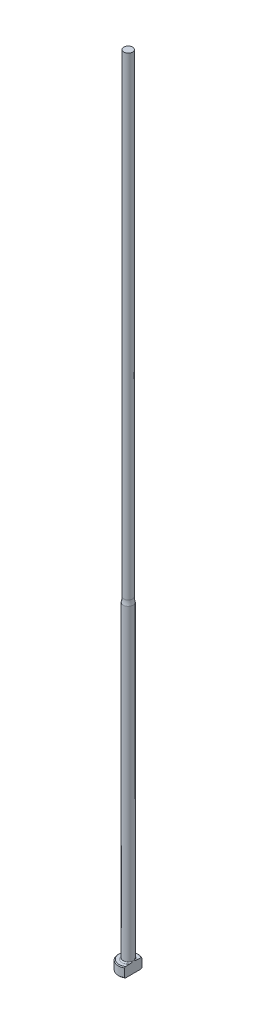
ISO-10303-21;
HEADER;
FILE_DESCRIPTION(('STEP AP214'),'2;1');
FILE_NAME('part.step','',(''),(''),'','','');
FILE_SCHEMA(('AUTOMOTIVE_DESIGN { 1 0 10303 214 1 1 1 1 }'));
ENDSEC;
DATA;
#1=APPLICATION_CONTEXT('core data for automotive mechanical design processes');
#2=APPLICATION_PROTOCOL_DEFINITION('international standard','automotive_design',2000,#1);
#3=PRODUCT_CONTEXT('',#1,'mechanical');
#4=PRODUCT('Part','Part','',(#3));
#5=PRODUCT_RELATED_PRODUCT_CATEGORY('part','',(#4));
#6=PRODUCT_DEFINITION_FORMATION('','',#4);
#7=PRODUCT_DEFINITION_CONTEXT('part definition',#1,'design');
#8=PRODUCT_DEFINITION('design','',#6,#7);
#9=PRODUCT_DEFINITION_SHAPE('','',#8);
#10=(LENGTH_UNIT() NAMED_UNIT(*) SI_UNIT(.MILLI.,.METRE.));
#11=(NAMED_UNIT(*) PLANE_ANGLE_UNIT() SI_UNIT($,.RADIAN.));
#12=(NAMED_UNIT(*) SI_UNIT($,.STERADIAN.) SOLID_ANGLE_UNIT());
#13=UNCERTAINTY_MEASURE_WITH_UNIT(LENGTH_MEASURE(1.E-05),#10,'distance_accuracy_value','');
#14=(GEOMETRIC_REPRESENTATION_CONTEXT(3) GLOBAL_UNCERTAINTY_ASSIGNED_CONTEXT((#13)) GLOBAL_UNIT_ASSIGNED_CONTEXT((#10,
#11,#12)) REPRESENTATION_CONTEXT('',''));
#15=CARTESIAN_POINT('',(0.,0.,0.));
#16=DIRECTION('',(0.,0.,1.));
#17=DIRECTION('',(1.,0.,0.));
#18=AXIS2_PLACEMENT_3D('',#15,#16,#17);
#19=CARTESIAN_POINT('',(-3.17499999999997,3.175,0.));
#20=DIRECTION('',(0.,1.,0.));
#21=DIRECTION('',(0.,0.,1.));
#22=AXIS2_PLACEMENT_3D('',#19,#20,#21);
#23=PLANE('',#22);
#24=CARTESIAN_POINT('',(0.,3.175,0.));
#25=DIRECTION('',(0.,1.,0.));
#26=DIRECTION('',(0.,0.,1.));
#27=AXIS2_PLACEMENT_3D('',#24,#25,#26);
#28=CIRCLE('',#27,2.92099999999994);
#29=CARTESIAN_POINT('',(1.58749999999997,3.175,-2.45195529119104));
#30=VERTEX_POINT('',#29);
#31=CARTESIAN_POINT('',(1.58749999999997,3.175,2.45195529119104));
#32=VERTEX_POINT('',#31);
#33=EDGE_CURVE('E105',#30,#32,#28,.T.);
#34=ORIENTED_EDGE('',*,*,#33,.T.);
#35=DIRECTION('',(0.,0.,1.));
#36=VECTOR('',#35,1.);
#37=CARTESIAN_POINT('',(1.58749999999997,3.17499999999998,2.74963065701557));
#38=LINE('',#37,#36);
#39=CARTESIAN_POINT('',(1.58749999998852,3.175,1.16397422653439));
#40=VERTEX_POINT('',#39);
#41=EDGE_CURVE('E126',#40,#32,#38,.T.);
#42=ORIENTED_EDGE('',*,*,#41,.F.);
#43=CARTESIAN_POINT('',(0.,3.175,0.));
#44=DIRECTION('',(0.,1.,0.));
#45=DIRECTION('',(0.,0.,1.));
#46=AXIS2_PLACEMENT_3D('',#43,#44,#45);
#47=CIRCLE('',#46,1.96849999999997);
#48=CARTESIAN_POINT('',(1.58749999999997,3.175,-1.16397422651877));
#49=VERTEX_POINT('',#48);
#50=EDGE_CURVE('E11',#40,#49,#47,.F.);
#51=ORIENTED_EDGE('',*,*,#50,.T.);
#52=EDGE_CURVE('E52',#30,#49,#38,.T.);
#53=ORIENTED_EDGE('',*,*,#52,.F.);
#54=EDGE_LOOP('',(#34,#42,#51,#53));
#55=FACE_BOUND('',#54,.T.);
#56=ADVANCED_FACE('F32',(#55),#23,.T.);
#57=CARTESIAN_POINT('',(0.,259.958771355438,0.));
#58=DIRECTION('',(0.,1.,0.));
#59=DIRECTION('',(0.,0.,1.));
#60=AXIS2_PLACEMENT_3D('',#57,#58,#59);
#61=CYLINDRICAL_SURFACE('',#60,3.17499999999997);
#62=CARTESIAN_POINT('',(0.,2.92100000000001,0.));
#63=DIRECTION('',(0.,1.,0.));
#64=DIRECTION('',(0.,0.,1.));
#65=AXIS2_PLACEMENT_3D('',#62,#63,#64);
#66=CIRCLE('',#65,3.17499999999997);
#67=CARTESIAN_POINT('',(1.58749999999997,2.92100000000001,2.74963065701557));
#68=VERTEX_POINT('',#67);
#69=CARTESIAN_POINT('',(1.58749999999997,2.92100000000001,-2.74963065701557));
#70=VERTEX_POINT('',#69);
#71=EDGE_CURVE('E98',#68,#70,#66,.F.);
#72=ORIENTED_EDGE('',*,*,#71,.T.);
#73=DIRECTION('',(0.,-1.,0.));
#74=VECTOR('',#73,1.);
#75=CARTESIAN_POINT('',(1.58749999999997,254.001,-2.74963065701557));
#76=LINE('',#75,#74);
#77=CARTESIAN_POINT('',(1.58749999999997,0.253999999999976,-2.74963065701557));
#78=VERTEX_POINT('',#77);
#79=EDGE_CURVE('E141',#70,#78,#76,.T.);
#80=ORIENTED_EDGE('',*,*,#79,.T.);
#81=CARTESIAN_POINT('',(0.,0.253999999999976,0.));
#82=DIRECTION('',(0.,-1.,0.));
#83=DIRECTION('',(0.,0.,-1.));
#84=AXIS2_PLACEMENT_3D('',#81,#82,#83);
#85=CIRCLE('',#84,3.17499999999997);
#86=CARTESIAN_POINT('',(1.58749999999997,0.253999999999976,2.74963065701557));
#87=VERTEX_POINT('',#86);
#88=EDGE_CURVE('E95',#78,#87,#85,.F.);
#89=ORIENTED_EDGE('',*,*,#88,.T.);
#90=DIRECTION('',(0.,-1.,0.));
#91=VECTOR('',#90,1.);
#92=CARTESIAN_POINT('',(1.58749999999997,254.001,2.74963065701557));
#93=LINE('',#92,#91);
#94=EDGE_CURVE('E88',#68,#87,#93,.T.);
#95=ORIENTED_EDGE('',*,*,#94,.F.);
#96=EDGE_LOOP('',(#72,#80,#89,#95));
#97=FACE_BOUND('',#96,.T.);
#98=ADVANCED_FACE('F191',(#97),#61,.T.);
#99=CARTESIAN_POINT('',(0.,0.,0.));
#100=DIRECTION('',(0.,-1.,0.));
#101=DIRECTION('',(0.,0.,-1.));
#102=AXIS2_PLACEMENT_3D('',#99,#100,#101);
#103=PLANE('',#102);
#104=CARTESIAN_POINT('',(0.,0.,0.));
#105=DIRECTION('',(0.,-1.,0.));
#106=DIRECTION('',(0.,0.,-1.));
#107=AXIS2_PLACEMENT_3D('',#104,#105,#106);
#108=CIRCLE('',#107,2.92100000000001);
#109=CARTESIAN_POINT('',(1.58749999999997,0.,2.45195529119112));
#110=VERTEX_POINT('',#109);
#111=CARTESIAN_POINT('',(1.58749999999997,0.,-2.45195529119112));
#112=VERTEX_POINT('',#111);
#113=EDGE_CURVE('E93',#110,#112,#108,.T.);
#114=ORIENTED_EDGE('',*,*,#113,.T.);
#115=DIRECTION('',(0.,0.,1.));
#116=VECTOR('',#115,1.);
#117=CARTESIAN_POINT('',(1.58749999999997,0.,2.74963065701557));
#118=LINE('',#117,#116);
#119=EDGE_CURVE('E78',#112,#110,#118,.T.);
#120=ORIENTED_EDGE('',*,*,#119,.T.);
#121=EDGE_LOOP('',(#114,#120));
#122=FACE_BOUND('',#121,.T.);
#123=ADVANCED_FACE('F97',(#122),#103,.T.);
#124=CARTESIAN_POINT('',(0.,3.17499999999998,0.));
#125=DIRECTION('',(0.,-1.,0.));
#126=DIRECTION('',(0.,0.,-1.));
#127=AXIS2_PLACEMENT_3D('',#124,#125,#126);
#128=CONICAL_SURFACE('',#127,2.92099999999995,0.785398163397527);
#129=ORIENTED_EDGE('',*,*,#71,.F.);
#130=CARTESIAN_POINT('',(1.58749999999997,-0.16162066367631,-6.0529050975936));
#131=CARTESIAN_POINT('',(1.58749999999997,-0.0288893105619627,-5.91567682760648));
#132=CARTESIAN_POINT('',(1.58749999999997,0.103699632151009,-5.7783103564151));
#133=CARTESIAN_POINT('',(1.58749999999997,0.368508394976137,-5.50321874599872));
#134=CARTESIAN_POINT('',(1.58749999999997,0.500728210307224,-5.36549360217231));
#135=CARTESIAN_POINT('',(1.58749999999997,0.764778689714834,-5.08953516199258));
#136=CARTESIAN_POINT('',(1.58749999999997,0.896609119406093,-4.9513016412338));
#137=CARTESIAN_POINT('',(1.58749999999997,1.15968706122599,-4.67428233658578));
#138=CARTESIAN_POINT('',(1.58749999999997,1.29093457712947,-4.53549655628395));
#139=CARTESIAN_POINT('',(1.58749999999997,1.55007705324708,-4.25997724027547));
#140=CARTESIAN_POINT('',(1.58749999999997,1.67798684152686,-4.12325766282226));
#141=CARTESIAN_POINT('',(1.58749999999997,1.9328486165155,-3.84892898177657));
#142=CARTESIAN_POINT('',(1.58749999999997,2.05980060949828,-3.71131988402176));
#143=CARTESIAN_POINT('',(1.58749999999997,2.31237508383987,-3.43493978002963));
#144=CARTESIAN_POINT('',(1.58749999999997,2.43799784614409,-3.29616903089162));
#145=CARTESIAN_POINT('',(1.58749999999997,2.68741369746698,-3.01699558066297));
#146=CARTESIAN_POINT('',(1.58749999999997,2.81120686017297,-2.8765929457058));
#147=CARTESIAN_POINT('',(1.58749999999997,3.00875865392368,-2.64816703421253));
#148=CARTESIAN_POINT('',(1.58749999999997,3.08336151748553,-2.56087478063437));
#149=CARTESIAN_POINT('',(1.58749999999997,3.2312387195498,-2.38515423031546));
#150=CARTESIAN_POINT('',(1.58749999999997,3.30451292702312,-2.29672582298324));
#151=CARTESIAN_POINT('',(1.58749999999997,3.45004422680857,-2.1174740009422));
#152=CARTESIAN_POINT('',(1.58749999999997,3.5222823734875,-2.02663514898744));
#153=CARTESIAN_POINT('',(1.58749999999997,3.66423097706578,-1.8430252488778));
#154=CARTESIAN_POINT('',(1.58749999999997,3.73394203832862,-1.75025467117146));
#155=CARTESIAN_POINT('',(1.58749999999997,3.87080633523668,-1.5606747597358));
#156=CARTESIAN_POINT('',(1.58749999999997,3.93790459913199,-1.46382547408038));
#157=CARTESIAN_POINT('',(1.58749999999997,4.06669147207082,-1.26632594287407));
#158=CARTESIAN_POINT('',(1.58749999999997,4.1283726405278,-1.16567073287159));
#159=CARTESIAN_POINT('',(1.58749999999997,4.21402252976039,-1.01165766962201));
#160=CARTESIAN_POINT('',(1.58749999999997,4.24127929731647,-0.960142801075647));
#161=CARTESIAN_POINT('',(1.58749999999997,4.2930979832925,-0.855780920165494));
#162=CARTESIAN_POINT('',(1.58749999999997,4.31765941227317,-0.802933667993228));
#163=CARTESIAN_POINT('',(1.58749999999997,4.38614656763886,-0.642461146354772));
#164=CARTESIAN_POINT('',(1.58749999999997,4.42510149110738,-0.532518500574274));
#165=CARTESIAN_POINT('',(1.58749999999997,4.46726244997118,-0.367680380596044));
#166=CARTESIAN_POINT('',(1.58749999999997,4.47844427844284,-0.314802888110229));
#167=CARTESIAN_POINT('',(1.58749999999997,4.49576654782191,-0.208209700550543));
#168=CARTESIAN_POINT('',(1.58749999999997,4.50190743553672,-0.154494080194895));
#169=CARTESIAN_POINT('',(1.58749999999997,4.50871296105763,-0.0468792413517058));
#170=CARTESIAN_POINT('',(1.58749999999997,4.5093945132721,0.00701889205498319));
#171=CARTESIAN_POINT('',(1.58749999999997,4.50527679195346,0.114606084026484));
#172=CARTESIAN_POINT('',(1.58749999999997,4.50047706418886,0.168295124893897));
#173=CARTESIAN_POINT('',(1.58749999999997,4.48579689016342,0.27448544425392));
#174=CARTESIAN_POINT('',(1.58749999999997,4.47596081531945,0.32699298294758));
#175=CARTESIAN_POINT('',(1.58749999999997,4.45181809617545,0.430974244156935));
#176=CARTESIAN_POINT('',(1.58749999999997,4.4375096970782,0.482447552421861));
#177=CARTESIAN_POINT('',(1.58749999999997,4.40502489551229,0.584460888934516));
#178=CARTESIAN_POINT('',(1.58749999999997,4.386827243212,0.634994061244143));
#179=CARTESIAN_POINT('',(1.58749999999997,4.34729308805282,0.734789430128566));
#180=CARTESIAN_POINT('',(1.58749999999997,4.3259572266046,0.784051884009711));
#181=CARTESIAN_POINT('',(1.58749999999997,4.25791922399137,0.930549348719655));
#182=CARTESIAN_POINT('',(1.58749999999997,4.20736047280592,1.0259880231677));
#183=CARTESIAN_POINT('',(1.58749999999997,4.0995545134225,1.21304313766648));
#184=CARTESIAN_POINT('',(1.58749999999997,4.04229912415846,1.30465471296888));
#185=CARTESIAN_POINT('',(1.58749999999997,3.92308746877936,1.48526211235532));
#186=CARTESIAN_POINT('',(1.58749999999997,3.86111349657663,1.57424615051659));
#187=CARTESIAN_POINT('',(1.58749999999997,3.73408621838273,1.74990003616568));
#188=CARTESIAN_POINT('',(1.58749999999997,3.66903444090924,1.83657099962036));
#189=CARTESIAN_POINT('',(1.58749999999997,3.53583371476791,2.00931764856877));
#190=CARTESIAN_POINT('',(1.58749999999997,3.46765527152,2.09537048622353));
#191=CARTESIAN_POINT('',(1.58749999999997,3.32960643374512,2.26611736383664));
#192=CARTESIAN_POINT('',(1.58749999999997,3.25973586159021,2.35081125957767));
#193=CARTESIAN_POINT('',(1.58749999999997,3.04858139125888,2.60290121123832));
#194=CARTESIAN_POINT('',(1.58749999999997,2.90542388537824,2.76872537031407));
#195=CARTESIAN_POINT('',(1.58749999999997,2.64069522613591,3.06970913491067));
#196=CARTESIAN_POINT('',(1.58749999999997,2.51959458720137,3.20528660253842));
#197=CARTESIAN_POINT('',(1.58749999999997,2.27590400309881,3.47510321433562));
#198=CARTESIAN_POINT('',(1.58749999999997,2.15331401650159,3.60934232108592));
#199=CARTESIAN_POINT('',(1.58749999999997,1.90694239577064,3.87695374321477));
#200=CARTESIAN_POINT('',(1.58749999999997,1.78315974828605,4.0103251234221));
#201=CARTESIAN_POINT('',(1.58749999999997,1.53478104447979,4.27630880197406));
#202=CARTESIAN_POINT('',(1.58749999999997,1.41018498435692,4.40892109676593));
#203=CARTESIAN_POINT('',(1.58749999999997,1.0457468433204,4.79499418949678));
#204=CARTESIAN_POINT('',(1.58749999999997,0.80507680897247,5.04767313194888));
#205=CARTESIAN_POINT('',(1.58749999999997,0.443121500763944,5.42550911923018));
#206=CARTESIAN_POINT('',(1.58749999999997,0.322378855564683,5.55118772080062));
#207=CARTESIAN_POINT('',(1.58749999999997,0.0805914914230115,5.80225207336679));
#208=CARTESIAN_POINT('',(1.58749999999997,-0.040453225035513,5.92763782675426));
#209=CARTESIAN_POINT('',(1.58749999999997,-0.161620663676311,6.0529050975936));
#210=B_SPLINE_CURVE_WITH_KNOTS('',3,(#130,#131,#132,#133,#134,#135,#136,#137,#138,#139,#140,
#141,#142,#143,#144,#145,#146,#147,#148,#149,#150,#151,#152,#153,#154,#155,#156,#157,#158,#159,
#160,#161,#162,#163,#164,#165,#166,#167,#168,#169,#170,#171,#172,#173,#174,#175,#176,#177,#178,
#179,#180,#181,#182,#183,#184,#185,#186,#187,#188,#189,#190,#191,#192,#193,#194,#195,#196,#197,
#198,#199,#200,#201,#202,#203,#204,#205,#206,#207,#208,#209),.UNSPECIFIED.,.F.,.F.,(4,2,2,2,2,2,
2,2,2,2,2,2,2,2,2,2,2,2,2,2,2,2,2,2,2,2,2,2,2,2,2,2,2,2,2,2,2,2,2,4),(0.,0.572750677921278,
1.14550874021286,1.71856057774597,2.29160869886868,2.85328006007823,3.4149477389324,
3.97649423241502,4.53801804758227,4.88249307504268,5.22700189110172,5.5751532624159,
5.92322081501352,6.27657800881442,6.63041319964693,6.80518126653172,6.9799810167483,
7.3282426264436,7.49018491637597,7.65211285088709,7.81353889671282,7.97497832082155,
8.13501929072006,8.29512313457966,8.45612518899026,8.61709438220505,8.94062993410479,
9.2645649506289,9.58978187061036,9.91483894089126,10.2441741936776,10.5735441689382,
11.2306812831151,11.7760337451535,12.3214014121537,12.8672825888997,13.4131663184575,
14.4600164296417,14.9828595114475,15.5056983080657),.UNSPECIFIED.);
#211=EDGE_CURVE('E118',#32,#68,#210,.T.);
#212=ORIENTED_EDGE('',*,*,#211,.F.);
#213=ORIENTED_EDGE('',*,*,#33,.F.);
#214=EDGE_CURVE('E117',#70,#30,#210,.T.);
#215=ORIENTED_EDGE('',*,*,#214,.F.);
#216=EDGE_LOOP('',(#129,#212,#213,#215));
#217=FACE_BOUND('',#216,.T.);
#218=ADVANCED_FACE('F162',(#217),#128,.T.);
#219=CARTESIAN_POINT('',(0.,0.253999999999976,0.));
#220=DIRECTION('',(0.,1.,0.));
#221=DIRECTION('',(0.,0.,1.));
#222=AXIS2_PLACEMENT_3D('',#219,#220,#221);
#223=CONICAL_SURFACE('',#222,3.17499999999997,0.785398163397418);
#224=ORIENTED_EDGE('',*,*,#88,.F.);
#225=CARTESIAN_POINT('',(1.58749999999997,3.33662066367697,6.0529050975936));
#226=CARTESIAN_POINT('',(1.58749999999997,3.20388931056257,5.91567682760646));
#227=CARTESIAN_POINT('',(1.58749999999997,3.07130036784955,5.77831035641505));
#228=CARTESIAN_POINT('',(1.58749999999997,2.80649160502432,5.50321874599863));
#229=CARTESIAN_POINT('',(1.58749999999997,2.67427178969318,5.3654936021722));
#230=CARTESIAN_POINT('',(1.58749999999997,2.41022131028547,5.08953516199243));
#231=CARTESIAN_POINT('',(1.58749999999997,2.27839088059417,4.95130164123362));
#232=CARTESIAN_POINT('',(1.58749999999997,2.01531293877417,4.67428233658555));
#233=CARTESIAN_POINT('',(1.58749999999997,1.88406542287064,4.5354965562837));
#234=CARTESIAN_POINT('',(1.58749999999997,1.62492294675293,4.25997724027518));
#235=CARTESIAN_POINT('',(1.58749999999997,1.49701315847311,4.12325766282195));
#236=CARTESIAN_POINT('',(1.58749999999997,1.24215138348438,3.84892898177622));
#237=CARTESIAN_POINT('',(1.58749999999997,1.11519939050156,3.71131988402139));
#238=CARTESIAN_POINT('',(1.58749999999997,0.862624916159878,3.43493978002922));
#239=CARTESIAN_POINT('',(1.58749999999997,0.737002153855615,3.29616903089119));
#240=CARTESIAN_POINT('',(1.58749999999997,0.487586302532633,3.01699558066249));
#241=CARTESIAN_POINT('',(1.58749999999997,0.363793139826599,2.8765929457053));
#242=CARTESIAN_POINT('',(1.58749999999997,0.166241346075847,2.64816703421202));
#243=CARTESIAN_POINT('',(1.58749999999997,0.0916384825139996,2.56087478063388));
#244=CARTESIAN_POINT('',(1.58749999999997,-0.0562387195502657,2.385154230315));
#245=CARTESIAN_POINT('',(1.58749999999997,-0.129512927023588,2.29672582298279));
#246=CARTESIAN_POINT('',(1.58749999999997,-0.27504422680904,2.11747400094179));
#247=CARTESIAN_POINT('',(1.58749999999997,-0.347282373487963,2.02663514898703));
#248=CARTESIAN_POINT('',(1.58749999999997,-0.489230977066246,1.84302524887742));
#249=CARTESIAN_POINT('',(1.58749999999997,-0.558942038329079,1.7502546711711));
#250=CARTESIAN_POINT('',(1.58749999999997,-0.695806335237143,1.56067475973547));
#251=CARTESIAN_POINT('',(1.58749999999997,-0.762904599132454,1.46382547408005));
#252=CARTESIAN_POINT('',(1.58749999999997,-0.891691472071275,1.26632594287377));
#253=CARTESIAN_POINT('',(1.58749999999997,-0.953372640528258,1.16567073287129));
#254=CARTESIAN_POINT('',(1.58749999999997,-1.03902252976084,1.01165766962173));
#255=CARTESIAN_POINT('',(1.58749999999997,-1.06627929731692,0.960142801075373));
#256=CARTESIAN_POINT('',(1.58749999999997,-1.11809798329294,0.85578092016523));
#257=CARTESIAN_POINT('',(1.58749999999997,-1.14265941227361,0.802933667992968));
#258=CARTESIAN_POINT('',(1.58749999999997,-1.21114656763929,0.642461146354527));
#259=CARTESIAN_POINT('',(1.58749999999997,-1.2501014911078,0.532518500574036));
#260=CARTESIAN_POINT('',(1.58749999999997,-1.29226244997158,0.367680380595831));
#261=CARTESIAN_POINT('',(1.58749999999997,-1.30344427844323,0.314802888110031));
#262=CARTESIAN_POINT('',(1.58749999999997,-1.32076654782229,0.208209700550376));
#263=CARTESIAN_POINT('',(1.58749999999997,-1.3269074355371,0.154494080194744));
#264=CARTESIAN_POINT('',(1.58749999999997,-1.333712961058,0.0468792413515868));
#265=CARTESIAN_POINT('',(1.58749999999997,-1.33439451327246,-0.00701889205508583));
#266=CARTESIAN_POINT('',(1.58749999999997,-1.33027679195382,-0.114606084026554));
#267=CARTESIAN_POINT('',(1.58749999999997,-1.32547706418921,-0.168295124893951));
#268=CARTESIAN_POINT('',(1.58749999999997,-1.31079689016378,-0.274485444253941));
#269=CARTESIAN_POINT('',(1.58749999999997,-1.3009608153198,-0.326992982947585));
#270=CARTESIAN_POINT('',(1.58749999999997,-1.27681809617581,-0.430974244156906));
#271=CARTESIAN_POINT('',(1.58749999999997,-1.26250969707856,-0.482447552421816));
#272=CARTESIAN_POINT('',(1.58749999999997,-1.23002489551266,-0.584460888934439));
#273=CARTESIAN_POINT('',(1.58749999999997,-1.21182724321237,-0.634994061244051));
#274=CARTESIAN_POINT('',(1.58749999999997,-1.1722930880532,-0.734789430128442));
#275=CARTESIAN_POINT('',(1.58749999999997,-1.15095722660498,-0.784051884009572));
#276=CARTESIAN_POINT('',(1.58749999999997,-1.08291922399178,-0.93054934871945));
#277=CARTESIAN_POINT('',(1.58749999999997,-1.03236047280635,-1.02598802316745));
#278=CARTESIAN_POINT('',(1.58749999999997,-0.924554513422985,-1.21304313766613));
#279=CARTESIAN_POINT('',(1.58749999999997,-0.86729912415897,-1.30465471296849));
#280=CARTESIAN_POINT('',(1.58749999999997,-0.748087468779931,-1.48526211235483));
#281=CARTESIAN_POINT('',(1.58749999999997,-0.686113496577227,-1.57424615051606));
#282=CARTESIAN_POINT('',(1.58749999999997,-0.55908621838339,-1.74990003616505));
#283=CARTESIAN_POINT('',(1.58749999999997,-0.494034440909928,-1.83657099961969));
#284=CARTESIAN_POINT('',(1.58749999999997,-0.360833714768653,-2.00931764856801));
#285=CARTESIAN_POINT('',(1.58749999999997,-0.292655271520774,-2.09537048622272));
#286=CARTESIAN_POINT('',(1.58749999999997,-0.154606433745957,-2.26611736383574));
#287=CARTESIAN_POINT('',(1.58749999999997,-0.0847358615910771,-2.35081125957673));
#288=CARTESIAN_POINT('',(1.58749999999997,0.126418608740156,-2.60290121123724));
#289=CARTESIAN_POINT('',(1.58749999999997,0.269576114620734,-2.76872537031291));
#290=CARTESIAN_POINT('',(1.58749999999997,0.534304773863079,-3.06970913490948));
#291=CARTESIAN_POINT('',(1.58749999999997,0.655405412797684,-3.20528660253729));
#292=CARTESIAN_POINT('',(1.58749999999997,0.899095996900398,-3.47510321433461));
#293=CARTESIAN_POINT('',(1.58749999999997,1.02168598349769,-3.60934232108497));
#294=CARTESIAN_POINT('',(1.58749999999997,1.26805760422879,-3.87695374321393));
#295=CARTESIAN_POINT('',(1.58749999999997,1.39184025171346,-4.01032512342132));
#296=CARTESIAN_POINT('',(1.58749999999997,1.64021895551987,-4.2763088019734));
#297=CARTESIAN_POINT('',(1.58749999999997,1.76481501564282,-4.40892109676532));
#298=CARTESIAN_POINT('',(1.58749999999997,2.12925315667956,-4.79499418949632));
#299=CARTESIAN_POINT('',(1.58749999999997,2.36992319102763,-5.04767313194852));
#300=CARTESIAN_POINT('',(1.58749999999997,2.73187849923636,-5.42550911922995));
#301=CARTESIAN_POINT('',(1.58749999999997,2.85262114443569,-5.55118772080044));
#302=CARTESIAN_POINT('',(1.58749999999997,3.09440850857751,-5.8022520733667));
#303=CARTESIAN_POINT('',(1.58749999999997,3.2154532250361,-5.92763782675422));
#304=CARTESIAN_POINT('',(1.58749999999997,3.33662066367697,-6.0529050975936));
#305=B_SPLINE_CURVE_WITH_KNOTS('',3,(#225,#226,#227,#228,#229,#230,#231,#232,#233,#234,#235,
#236,#237,#238,#239,#240,#241,#242,#243,#244,#245,#246,#247,#248,#249,#250,#251,#252,#253,#254,
#255,#256,#257,#258,#259,#260,#261,#262,#263,#264,#265,#266,#267,#268,#269,#270,#271,#272,#273,
#274,#275,#276,#277,#278,#279,#280,#281,#282,#283,#284,#285,#286,#287,#288,#289,#290,#291,#292,
#293,#294,#295,#296,#297,#298,#299,#300,#301,#302,#303,#304),.UNSPECIFIED.,.F.,.F.,(4,2,2,2,2,2,
2,2,2,2,2,2,2,2,2,2,2,2,2,2,2,2,2,2,2,2,2,2,2,2,2,2,2,2,2,2,2,2,2,4),(0.,0.57275067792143,
1.14550874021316,1.71856057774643,2.29160869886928,2.85328006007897,3.41494773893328,
3.97649423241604,4.53801804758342,4.88249307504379,5.2270018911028,5.57515326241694,
5.92322081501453,6.27657800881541,6.63041319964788,6.80518126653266,6.97998101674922,
7.32824262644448,7.49018491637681,7.65211285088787,7.81353889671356,7.97497832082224,
8.1350192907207,8.29512313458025,8.45612518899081,8.61709438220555,8.94062993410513,
9.26456495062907,9.58978187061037,9.91483894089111,10.2441741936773,10.5735441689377,
11.2306812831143,11.776033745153,12.3214014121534,12.8672825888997,13.4131663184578,
14.4600164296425,14.9828595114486,15.505698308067),.UNSPECIFIED.);
#306=EDGE_CURVE('E81',#112,#78,#305,.T.);
#307=ORIENTED_EDGE('',*,*,#306,.F.);
#308=ORIENTED_EDGE('',*,*,#113,.F.);
#309=EDGE_CURVE('E84',#87,#110,#305,.T.);
#310=ORIENTED_EDGE('',*,*,#309,.F.);
#311=EDGE_LOOP('',(#224,#307,#308,#310));
#312=FACE_BOUND('',#311,.T.);
#313=ADVANCED_FACE('F92',(#312),#223,.T.);
#314=CARTESIAN_POINT('',(0.,3.556,0.));
#315=DIRECTION('',(0.,1.,0.));
#316=DIRECTION('',(0.,0.,1.));
#317=AXIS2_PLACEMENT_3D('',#314,#315,#316);
#318=TOROIDAL_SURFACE('',#317,1.96849999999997,0.381);
#319=CARTESIAN_POINT('',(1.58749999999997,3.556,0.));
#320=CARTESIAN_POINT('',(1.58749999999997,3.55599928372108,-9.72839998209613E-12));
#321=CARTESIAN_POINT('',(1.58749999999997,3.55599856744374,-1.16390048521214E-07));
#322=CARTESIAN_POINT('',(1.58749999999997,3.55599717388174,-5.02802253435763E-07));
#323=CARTESIAN_POINT('',(1.58749999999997,3.55599649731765,-7.75049116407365E-07));
#324=CARTESIAN_POINT('',(1.58749999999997,3.55599515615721,-1.43578185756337E-06));
#325=CARTESIAN_POINT('',(1.58749999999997,3.55599449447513,-1.83004116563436E-06));
#326=CARTESIAN_POINT('',(1.58749999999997,3.55599322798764,-2.69326525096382E-06));
#327=CARTESIAN_POINT('',(1.58749999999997,3.55599262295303,-3.16190628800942E-06));
#328=CARTESIAN_POINT('',(1.58749999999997,3.55599066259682,-4.80183833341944E-06));
#329=CARTESIAN_POINT('',(1.58749999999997,3.55598938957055,-6.07237548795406E-06));
#330=CARTESIAN_POINT('',(1.58749999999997,3.55598706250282,-8.74131694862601E-06));
#331=CARTESIAN_POINT('',(1.58749999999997,3.55598600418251,-1.01362054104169E-05));
#332=CARTESIAN_POINT('',(1.58749999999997,3.55598220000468,-1.54025644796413E-05));
#333=CARTESIAN_POINT('',(1.58749999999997,3.55597966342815,-1.94297992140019E-05));
#334=CARTESIAN_POINT('',(1.58749999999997,3.55597535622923,-2.75116574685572E-05));
#335=CARTESIAN_POINT('',(1.58749999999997,3.55597354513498,-3.15456374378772E-05));
#336=CARTESIAN_POINT('',(1.58749999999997,3.55596616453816,-4.82039076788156E-05));
#337=CARTESIAN_POINT('',(1.58749999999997,3.55596077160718,-6.08993138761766E-05));
#338=CARTESIAN_POINT('',(1.58749999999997,3.55595181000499,-8.49758225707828E-05));
#339=CARTESIAN_POINT('',(1.58749999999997,3.55594809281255,-9.6299831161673E-05));
#340=CARTESIAN_POINT('',(1.58749999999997,3.55591954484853,-0.000176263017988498));
#341=CARTESIAN_POINT('',(1.58749999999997,3.55588430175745,-0.000240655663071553));
#342=CARTESIAN_POINT('',(1.58749999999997,3.55575419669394,-0.000487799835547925));
#343=CARTESIAN_POINT('',(1.58749999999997,3.55566706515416,-0.000673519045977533));
#344=CARTESIAN_POINT('',(1.58749999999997,3.55532896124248,-0.00138308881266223));
#345=CARTESIAN_POINT('',(1.58749999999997,3.55506990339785,-0.0019038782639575));
#346=CARTESIAN_POINT('',(1.58749999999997,3.55403272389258,-0.00399959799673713));
#347=CARTESIAN_POINT('',(1.58749999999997,3.55326363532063,-0.0055779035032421));
#348=CARTESIAN_POINT('',(1.58749999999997,3.53734419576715,-0.0382341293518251));
#349=CARTESIAN_POINT('',(1.58749999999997,3.52209124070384,-0.0692744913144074));
#350=CARTESIAN_POINT('',(1.58749999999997,3.49234031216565,-0.130397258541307));
#351=CARTESIAN_POINT('',(1.58749999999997,3.4778343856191,-0.160476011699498));
#352=CARTESIAN_POINT('',(1.58749999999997,3.44756579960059,-0.22405302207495));
#353=CARTESIAN_POINT('',(1.58749999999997,3.43183768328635,-0.257567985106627));
#354=CARTESIAN_POINT('',(1.58749999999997,3.40084315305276,-0.325196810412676));
#355=CARTESIAN_POINT('',(1.58749999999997,3.38558252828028,-0.359313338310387));
#356=CARTESIAN_POINT('',(1.58749999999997,3.35947844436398,-0.419670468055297));
#357=CARTESIAN_POINT('',(1.58749999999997,3.34845502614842,-0.445832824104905));
#358=CARTESIAN_POINT('',(1.58749999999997,3.32703860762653,-0.498343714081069));
#359=CARTESIAN_POINT('',(1.58749999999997,3.31664422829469,-0.52469168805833));
#360=CARTESIAN_POINT('',(1.58749999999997,3.2869407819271,-0.603098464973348));
#361=CARTESIAN_POINT('',(1.58749999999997,3.26865317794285,-0.655557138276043));
#362=CARTESIAN_POINT('',(1.58749999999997,3.24332469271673,-0.737608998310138));
#363=CARTESIAN_POINT('',(1.58749999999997,3.23494346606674,-0.766787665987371));
#364=CARTESIAN_POINT('',(1.58749999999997,3.21949479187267,-0.825628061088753));
#365=CARTESIAN_POINT('',(1.58749999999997,3.21243348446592,-0.855291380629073));
#366=CARTESIAN_POINT('',(1.58749999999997,3.19303275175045,-0.947623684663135));
#367=CARTESIAN_POINT('',(1.58749999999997,3.18336484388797,-1.01091582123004));
#368=CARTESIAN_POINT('',(1.58749999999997,3.17464826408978,-1.12491727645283));
#369=CARTESIAN_POINT('',(1.58749999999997,3.17379742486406,-1.17548103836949));
#370=CARTESIAN_POINT('',(1.58749999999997,3.17980825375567,-1.2756075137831));
#371=CARTESIAN_POINT('',(1.58749999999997,3.18656467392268,-1.32517446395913));
#372=CARTESIAN_POINT('',(1.58749999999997,3.20510062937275,-1.40268723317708));
#373=CARTESIAN_POINT('',(1.58749999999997,3.21379930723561,-1.43136704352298));
#374=CARTESIAN_POINT('',(1.58749999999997,3.23523847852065,-1.48727388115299));
#375=CARTESIAN_POINT('',(1.58749999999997,3.24798385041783,-1.51449910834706));
#376=CARTESIAN_POINT('',(1.58749999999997,3.27479889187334,-1.56082978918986));
#377=CARTESIAN_POINT('',(1.58749999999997,3.2880084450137,-1.5804296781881));
#378=CARTESIAN_POINT('',(1.58749999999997,3.31738741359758,-1.61726850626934));
#379=CARTESIAN_POINT('',(1.58749999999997,3.33355126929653,-1.63451177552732));
#380=CARTESIAN_POINT('',(1.58749999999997,3.3650209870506,-1.66235366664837));
#381=CARTESIAN_POINT('',(1.58749999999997,3.37976591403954,-1.67358404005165));
#382=CARTESIAN_POINT('',(1.58749999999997,3.41090649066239,-1.69348690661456));
#383=CARTESIAN_POINT('',(1.58749999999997,3.42730148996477,-1.70216040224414));
#384=CARTESIAN_POINT('',(1.58749999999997,3.46152587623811,-1.71647536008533));
#385=CARTESIAN_POINT('',(1.58749999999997,3.47936500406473,-1.72209384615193));
#386=CARTESIAN_POINT('',(1.58749999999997,3.51579449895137,-1.72977101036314));
#387=CARTESIAN_POINT('',(1.58749999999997,3.53438431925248,-1.73183223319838));
#388=CARTESIAN_POINT('',(1.58749999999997,3.5693049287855,-1.73220894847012));
#389=CARTESIAN_POINT('',(1.58749999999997,3.58563247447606,-1.73095378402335));
#390=CARTESIAN_POINT('',(1.58749999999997,3.61782719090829,-1.72566824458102));
#391=CARTESIAN_POINT('',(1.58749999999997,3.6336944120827,-1.72163817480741));
#392=CARTESIAN_POINT('',(1.58749999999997,3.66430913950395,-1.71112762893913));
#393=CARTESIAN_POINT('',(1.58749999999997,3.67907021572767,-1.70468621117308));
#394=CARTESIAN_POINT('',(1.58749999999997,3.7074589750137,-1.68967506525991));
#395=CARTESIAN_POINT('',(1.58749999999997,3.72108625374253,-1.68110458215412));
#396=CARTESIAN_POINT('',(1.58749999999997,3.75190835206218,-1.6586320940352));
#397=CARTESIAN_POINT('',(1.58749999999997,3.76852524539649,-1.64393589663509));
#398=CARTESIAN_POINT('',(1.58749999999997,3.79915076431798,-1.61203006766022));
#399=CARTESIAN_POINT('',(1.58749999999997,3.81315342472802,-1.59481484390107));
#400=CARTESIAN_POINT('',(1.58749999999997,3.84335302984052,-1.55180967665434));
#401=CARTESIAN_POINT('',(1.58749999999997,3.85840997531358,-1.52522183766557));
#402=CARTESIAN_POINT('',(1.58749999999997,3.8840928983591,-1.47008223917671));
#403=CARTESIAN_POINT('',(1.58749999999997,3.89472145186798,-1.44153163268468));
#404=CARTESIAN_POINT('',(1.58749999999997,3.91656912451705,-1.36850699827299));
#405=CARTESIAN_POINT('',(1.58749999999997,3.92534811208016,-1.32330828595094));
#406=CARTESIAN_POINT('',(1.58749999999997,3.93598980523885,-1.23163561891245));
#407=CARTESIAN_POINT('',(1.58749999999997,3.93776012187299,-1.18515271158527));
#408=CARTESIAN_POINT('',(1.58749999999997,3.93485724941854,-1.056626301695));
#409=CARTESIAN_POINT('',(1.58749999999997,3.9241811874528,-0.974728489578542));
#410=CARTESIAN_POINT('',(1.58749999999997,3.899893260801,-0.855941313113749));
#411=CARTESIAN_POINT('',(1.58749999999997,3.89075037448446,-0.817952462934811));
#412=CARTESIAN_POINT('',(1.58749999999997,3.87034922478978,-0.742758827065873));
#413=CARTESIAN_POINT('',(1.58749999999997,3.85910312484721,-0.705550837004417));
#414=CARTESIAN_POINT('',(1.58749999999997,3.83067738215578,-0.618900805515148));
#415=CARTESIAN_POINT('',(1.58749999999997,3.81279292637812,-0.56969368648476));
#416=CARTESIAN_POINT('',(1.58749999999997,3.78404415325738,-0.496059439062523));
#417=CARTESIAN_POINT('',(1.58749999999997,3.77402894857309,-0.471293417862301));
#418=CARTESIAN_POINT('',(1.58749999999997,3.75347166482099,-0.421913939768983));
#419=CARTESIAN_POINT('',(1.58749999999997,3.74292842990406,-0.39730096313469));
#420=CARTESIAN_POINT('',(1.58749999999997,3.71797467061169,-0.340371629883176));
#421=CARTESIAN_POINT('',(1.58749999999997,3.7034106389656,-0.308122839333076));
#422=CARTESIAN_POINT('',(1.58749999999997,3.67389634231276,-0.244169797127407));
#423=CARTESIAN_POINT('',(1.58749999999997,3.65895097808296,-0.212463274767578));
#424=CARTESIAN_POINT('',(1.58749999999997,3.63022587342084,-0.152300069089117));
#425=CARTESIAN_POINT('',(1.58749999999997,3.61647532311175,-0.123829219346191));
#426=CARTESIAN_POINT('',(1.58749999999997,3.58829058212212,-0.065967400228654));
#427=CARTESIAN_POINT('',(1.58749999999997,3.57384944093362,-0.036579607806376));
#428=CARTESIAN_POINT('',(1.58749999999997,3.55873641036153,-0.00557801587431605));
#429=CARTESIAN_POINT('',(1.58749999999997,3.557967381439,-0.00399981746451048));
#430=CARTESIAN_POINT('',(1.58749999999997,3.55693021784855,-0.00190412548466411));
#431=CARTESIAN_POINT('',(1.58749999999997,3.55667111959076,-0.00138325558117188));
#432=CARTESIAN_POINT('',(1.58749999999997,3.55633296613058,-0.00067358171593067));
#433=CARTESIAN_POINT('',(1.58749999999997,3.55624582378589,-0.000487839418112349));
#434=CARTESIAN_POINT('',(1.58749999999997,3.55611570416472,-0.000240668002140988));
#435=CARTESIAN_POINT('',(1.58749999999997,3.55608045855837,-0.000176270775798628));
#436=CARTESIAN_POINT('',(1.58749999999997,3.55605190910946,-9.63021903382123E-05));
#437=CARTESIAN_POINT('',(1.58749999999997,3.55604819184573,-8.49777827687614E-05));
#438=CARTESIAN_POINT('',(1.58749999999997,3.55603922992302,-6.09004217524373E-05));
#439=CARTESIAN_POINT('',(1.58749999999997,3.55603383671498,-4.82045726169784E-05));
#440=CARTESIAN_POINT('',(1.58749999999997,3.55602645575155,-3.15458034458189E-05));
#441=CARTESIAN_POINT('',(1.58749999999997,3.55602464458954,-2.75117552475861E-05));
#442=CARTESIAN_POINT('',(1.58749999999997,3.55602033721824,-1.94297725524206E-05));
#443=CARTESIAN_POINT('',(1.58749999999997,3.55601780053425,-1.54024835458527E-05));
#444=CARTESIAN_POINT('',(1.58749999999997,3.55601399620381,-1.01360754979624E-05));
#445=CARTESIAN_POINT('',(1.58749999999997,3.55601293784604,-8.7411813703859E-06));
#446=CARTESIAN_POINT('',(1.58749999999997,3.55601061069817,-6.07223627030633E-06));
#447=CARTESIAN_POINT('',(1.58749999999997,3.55600933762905,-4.80170138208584E-06));
#448=CARTESIAN_POINT('',(1.58749999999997,3.55600737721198,-3.16178168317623E-06));
#449=CARTESIAN_POINT('',(1.58749999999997,3.55600677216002,-2.69314602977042E-06));
#450=CARTESIAN_POINT('',(1.58749999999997,3.55600550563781,-1.82993577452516E-06));
#451=CARTESIAN_POINT('',(1.58749999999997,3.55600484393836,-1.43568493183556E-06));
#452=CARTESIAN_POINT('',(1.58749999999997,3.55600350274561,-7.74972790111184E-07));
#453=CARTESIAN_POINT('',(1.58749999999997,3.55600282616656,-5.02737772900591E-07));
#454=CARTESIAN_POINT('',(1.58749999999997,3.55600143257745,-1.16354060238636E-07));
#455=CARTESIAN_POINT('',(1.58749999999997,3.55600071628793,9.72852226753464E-12));
#456=CARTESIAN_POINT('',(1.58749999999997,3.556,0.));
#457=B_SPLINE_CURVE_WITH_KNOTS('',3,(#319,#320,#321,#322,#323,#324,#325,#326,#327,#328,#329,
#330,#331,#332,#333,#334,#335,#336,#337,#338,#339,#340,#341,#342,#343,#344,#345,#346,#347,#348,
#349,#350,#351,#352,#353,#354,#355,#356,#357,#358,#359,#360,#361,#362,#363,#364,#365,#366,#367,
#368,#369,#370,#371,#372,#373,#374,#375,#376,#377,#378,#379,#380,#381,#382,#383,#384,#385,#386,
#387,#388,#389,#390,#391,#392,#393,#394,#395,#396,#397,#398,#399,#400,#401,#402,#403,#404,#405,
#406,#407,#408,#409,#410,#411,#412,#413,#414,#415,#416,#417,#418,#419,#420,#421,#422,#423,#424,
#425,#426,#427,#428,#429,#430,#431,#432,#433,#434,#435,#436,#437,#438,#439,#440,#441,#442,#443,
#444,#445,#446,#447,#448,#449,#450,#451,#452,#453,#454,#455,#456),.UNSPECIFIED.,.T.,.F.,(4,2,2,
2,2,2,2,2,2,2,2,2,2,2,2,2,2,2,2,2,2,2,2,2,2,2,2,2,2,2,2,2,2,2,2,2,2,2,2,2,2,2,2,2,2,2,2,2,2,2,2,
2,2,2,2,2,2,2,2,2,2,2,2,2,2,2,2,2,4),(0.,2.14653634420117E-06,4.3243617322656E-06,
6.62715069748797E-06,8.92017875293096E-06,1.42892293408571E-05,1.95376032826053E-05,
3.37616071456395E-05,4.70144492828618E-05,8.83789092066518E-05,0.000124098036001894,
0.000343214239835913,0.000959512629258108,0.00270343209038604,0.00797166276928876,
0.11171345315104,0.21189766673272,0.322958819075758,0.435072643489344,0.520234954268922,
0.605203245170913,0.771741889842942,0.862787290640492,0.954246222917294,1.14571222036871,
1.29701464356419,1.44624921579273,1.53592478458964,1.62570887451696,1.69637166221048,
1.76690281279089,1.82229027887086,1.87765600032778,1.93343255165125,1.98916918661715,
2.03805361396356,2.08693266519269,2.13505202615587,2.18318847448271,2.24937187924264,
2.31570450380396,2.4068617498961,2.49796589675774,2.63532677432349,2.77449244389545,
3.02069049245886,3.13789423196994,3.25444001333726,3.41142684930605,3.491566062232,
3.57188909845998,3.67803747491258,3.78319074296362,3.87804579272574,3.97626481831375,
3.98153268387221,3.98327687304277,3.98389324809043,3.98411237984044,3.98414810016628,
3.98418946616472,3.98420271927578,3.98421694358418,3.98422219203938,3.9842275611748,
3.98422985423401,3.98423215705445,3.98423433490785,3.98423648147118),.UNSPECIFIED.);
#458=CARTESIAN_POINT('',(1.58749999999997,3.556,0.));
#459=VERTEX_POINT('',#458);
#460=EDGE_CURVE('E47',#459,#49,#457,.T.);
#461=ORIENTED_EDGE('',*,*,#460,.T.);
#462=ORIENTED_EDGE('',*,*,#50,.F.);
#463=CARTESIAN_POINT('',(1.58749999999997,3.556,0.));
#464=CARTESIAN_POINT('',(1.58749999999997,3.55600071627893,9.72842792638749E-12));
#465=CARTESIAN_POINT('',(1.58749999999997,3.55600143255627,1.16390048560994E-07));
#466=CARTESIAN_POINT('',(1.58749999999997,3.55600282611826,5.02802253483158E-07));
#467=CARTESIAN_POINT('',(1.58749999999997,3.55600350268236,7.7504911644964E-07));
#468=CARTESIAN_POINT('',(1.58749999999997,3.5560048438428,1.43578185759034E-06));
#469=CARTESIAN_POINT('',(1.58749999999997,3.55600550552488,1.83004116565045E-06));
#470=CARTESIAN_POINT('',(1.58749999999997,3.55600677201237,2.69326525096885E-06));
#471=CARTESIAN_POINT('',(1.58749999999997,3.55600737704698,3.16190628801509E-06));
#472=CARTESIAN_POINT('',(1.58749999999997,3.55600933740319,4.80183833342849E-06));
#473=CARTESIAN_POINT('',(1.58749999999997,3.55601061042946,6.07237548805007E-06));
#474=CARTESIAN_POINT('',(1.58749999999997,3.55601293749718,8.74131694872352E-06));
#475=CARTESIAN_POINT('',(1.58749999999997,3.55601399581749,1.01362054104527E-05));
#476=CARTESIAN_POINT('',(1.58749999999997,3.55601779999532,1.54025644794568E-05));
#477=CARTESIAN_POINT('',(1.58749999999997,3.55602033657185,1.94297992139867E-05));
#478=CARTESIAN_POINT('',(1.58749999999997,3.55602464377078,2.75116574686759E-05));
#479=CARTESIAN_POINT('',(1.58749999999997,3.55602645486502,3.15456374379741E-05));
#480=CARTESIAN_POINT('',(1.58749999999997,3.55603383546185,4.8203907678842E-05));
#481=CARTESIAN_POINT('',(1.58749999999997,3.55603922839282,6.0899313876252E-05));
#482=CARTESIAN_POINT('',(1.58749999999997,3.55604818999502,8.49758225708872E-05));
#483=CARTESIAN_POINT('',(1.58749999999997,3.55605190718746,9.62998311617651E-05));
#484=CARTESIAN_POINT('',(1.58749999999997,3.55608045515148,0.000176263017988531));
#485=CARTESIAN_POINT('',(1.58749999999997,3.55611569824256,0.000240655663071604));
#486=CARTESIAN_POINT('',(1.58749999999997,3.55624580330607,0.000487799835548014));
#487=CARTESIAN_POINT('',(1.58749999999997,3.55633293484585,0.000673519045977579));
#488=CARTESIAN_POINT('',(1.58749999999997,3.55667103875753,0.00138308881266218));
#489=CARTESIAN_POINT('',(1.58749999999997,3.55693009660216,0.00190387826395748));
#490=CARTESIAN_POINT('',(1.58749999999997,3.55796727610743,0.00399959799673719));
#491=CARTESIAN_POINT('',(1.58749999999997,3.55873636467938,0.00557790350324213));
#492=CARTESIAN_POINT('',(1.58749999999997,3.57465580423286,0.038234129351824));
#493=CARTESIAN_POINT('',(1.58749999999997,3.58990875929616,0.0692744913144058));
#494=CARTESIAN_POINT('',(1.58749999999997,3.61965968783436,0.130397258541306));
#495=CARTESIAN_POINT('',(1.58749999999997,3.63416561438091,0.160476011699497));
#496=CARTESIAN_POINT('',(1.58749999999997,3.66443420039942,0.22405302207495));
#497=CARTESIAN_POINT('',(1.58749999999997,3.68016231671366,0.257567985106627));
#498=CARTESIAN_POINT('',(1.58749999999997,3.71115684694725,0.325196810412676));
#499=CARTESIAN_POINT('',(1.58749999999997,3.72641747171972,0.359313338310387));
#500=CARTESIAN_POINT('',(1.58749999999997,3.75252155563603,0.419670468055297));
#501=CARTESIAN_POINT('',(1.58749999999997,3.76354497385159,0.445832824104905));
#502=CARTESIAN_POINT('',(1.58749999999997,3.78496139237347,0.498343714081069));
#503=CARTESIAN_POINT('',(1.58749999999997,3.79535577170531,0.524691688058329));
#504=CARTESIAN_POINT('',(1.58749999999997,3.82505921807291,0.603098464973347));
#505=CARTESIAN_POINT('',(1.58749999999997,3.84334682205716,0.655557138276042));
#506=CARTESIAN_POINT('',(1.58749999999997,3.86867530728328,0.737608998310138));
#507=CARTESIAN_POINT('',(1.58749999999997,3.87705653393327,0.766787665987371));
#508=CARTESIAN_POINT('',(1.58749999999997,3.89250520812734,0.825628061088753));
#509=CARTESIAN_POINT('',(1.58749999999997,3.89956651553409,0.855291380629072));
#510=CARTESIAN_POINT('',(1.58749999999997,3.91896724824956,0.947623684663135));
#511=CARTESIAN_POINT('',(1.58749999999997,3.92863515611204,1.01091582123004));
#512=CARTESIAN_POINT('',(1.58749999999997,3.93735173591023,1.12491727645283));
#513=CARTESIAN_POINT('',(1.58749999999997,3.93820257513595,1.17548103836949));
#514=CARTESIAN_POINT('',(1.58749999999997,3.93219174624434,1.2756075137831));
#515=CARTESIAN_POINT('',(1.58749999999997,3.92543532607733,1.32517446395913));
#516=CARTESIAN_POINT('',(1.58749999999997,3.90689937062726,1.40268723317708));
#517=CARTESIAN_POINT('',(1.58749999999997,3.8982006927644,1.43136704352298));
#518=CARTESIAN_POINT('',(1.58749999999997,3.87676152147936,1.48727388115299));
#519=CARTESIAN_POINT('',(1.58749999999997,3.86401614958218,1.51449910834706));
#520=CARTESIAN_POINT('',(1.58749999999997,3.83720110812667,1.56082978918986));
#521=CARTESIAN_POINT('',(1.58749999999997,3.82399155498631,1.5804296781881));
#522=CARTESIAN_POINT('',(1.58749999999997,3.79461258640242,1.61726850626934));
#523=CARTESIAN_POINT('',(1.58749999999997,3.77844873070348,1.63451177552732));
#524=CARTESIAN_POINT('',(1.58749999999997,3.74697901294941,1.66235366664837));
#525=CARTESIAN_POINT('',(1.58749999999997,3.73223408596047,1.67358404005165));
#526=CARTESIAN_POINT('',(1.58749999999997,3.70109350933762,1.69348690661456));
#527=CARTESIAN_POINT('',(1.58749999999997,3.68469851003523,1.70216040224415));
#528=CARTESIAN_POINT('',(1.58749999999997,3.65047412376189,1.71647536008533));
#529=CARTESIAN_POINT('',(1.58749999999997,3.63263499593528,1.72209384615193));
#530=CARTESIAN_POINT('',(1.58749999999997,3.59620550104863,1.72977101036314));
#531=CARTESIAN_POINT('',(1.58749999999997,3.57761568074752,1.73183223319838));
#532=CARTESIAN_POINT('',(1.58749999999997,3.54269507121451,1.73220894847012));
#533=CARTESIAN_POINT('',(1.58749999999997,3.52636752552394,1.73095378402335));
#534=CARTESIAN_POINT('',(1.58749999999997,3.49417280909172,1.72566824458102));
#535=CARTESIAN_POINT('',(1.58749999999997,3.47830558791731,1.72163817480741));
#536=CARTESIAN_POINT('',(1.58749999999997,3.44769086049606,1.71112762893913));
#537=CARTESIAN_POINT('',(1.58749999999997,3.43292978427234,1.70468621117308));
#538=CARTESIAN_POINT('',(1.58749999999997,3.40454102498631,1.68967506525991));
#539=CARTESIAN_POINT('',(1.58749999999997,3.39091374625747,1.68110458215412));
#540=CARTESIAN_POINT('',(1.58749999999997,3.36009164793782,1.6586320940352));
#541=CARTESIAN_POINT('',(1.58749999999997,3.34347475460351,1.64393589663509));
#542=CARTESIAN_POINT('',(1.58749999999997,3.31284923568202,1.61203006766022));
#543=CARTESIAN_POINT('',(1.58749999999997,3.29884657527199,1.59481484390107));
#544=CARTESIAN_POINT('',(1.58749999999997,3.26864697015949,1.55180967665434));
#545=CARTESIAN_POINT('',(1.58749999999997,3.25359002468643,1.52522183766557));
#546=CARTESIAN_POINT('',(1.58749999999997,3.22790710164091,1.47008223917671));
#547=CARTESIAN_POINT('',(1.58749999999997,3.21727854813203,1.44153163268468));
#548=CARTESIAN_POINT('',(1.58749999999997,3.19543087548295,1.36850699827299));
#549=CARTESIAN_POINT('',(1.58749999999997,3.18665188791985,1.32330828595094));
#550=CARTESIAN_POINT('',(1.58749999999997,3.17601019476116,1.23163561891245));
#551=CARTESIAN_POINT('',(1.58749999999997,3.17423987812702,1.18515271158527));
#552=CARTESIAN_POINT('',(1.58749999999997,3.17714275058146,1.05662630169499));
#553=CARTESIAN_POINT('',(1.58749999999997,3.18781881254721,0.974728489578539));
#554=CARTESIAN_POINT('',(1.58749999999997,3.21210673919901,0.855941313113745));
#555=CARTESIAN_POINT('',(1.58749999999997,3.22124962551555,0.817952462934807));
#556=CARTESIAN_POINT('',(1.58749999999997,3.24165077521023,0.742758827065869));
#557=CARTESIAN_POINT('',(1.58749999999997,3.25289687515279,0.705550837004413));
#558=CARTESIAN_POINT('',(1.58749999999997,3.28132261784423,0.618900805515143));
#559=CARTESIAN_POINT('',(1.58749999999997,3.29920707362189,0.569693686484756));
#560=CARTESIAN_POINT('',(1.58749999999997,3.32795584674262,0.496059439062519));
#561=CARTESIAN_POINT('',(1.58749999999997,3.33797105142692,0.471293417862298));
#562=CARTESIAN_POINT('',(1.58749999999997,3.35852833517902,0.42191393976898));
#563=CARTESIAN_POINT('',(1.58749999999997,3.36907157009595,0.397300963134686));
#564=CARTESIAN_POINT('',(1.58749999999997,3.39402532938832,0.340371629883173));
#565=CARTESIAN_POINT('',(1.58749999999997,3.40858936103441,0.308122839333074));
#566=CARTESIAN_POINT('',(1.58749999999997,3.43810365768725,0.244169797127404));
#567=CARTESIAN_POINT('',(1.58749999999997,3.45304902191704,0.212463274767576));
#568=CARTESIAN_POINT('',(1.58749999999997,3.48177412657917,0.152300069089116));
#569=CARTESIAN_POINT('',(1.58749999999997,3.49552467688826,0.123829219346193));
#570=CARTESIAN_POINT('',(1.58749999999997,3.52370941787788,0.0659674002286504));
#571=CARTESIAN_POINT('',(1.58749999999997,3.53815055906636,0.0365796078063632));
#572=CARTESIAN_POINT('',(1.58749999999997,3.55326358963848,0.00557801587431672));
#573=CARTESIAN_POINT('',(1.58749999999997,3.55403261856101,0.00399981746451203));
#574=CARTESIAN_POINT('',(1.58749999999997,3.55506978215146,0.00190412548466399));
#575=CARTESIAN_POINT('',(1.58749999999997,3.55532888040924,0.00138325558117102));
#576=CARTESIAN_POINT('',(1.58749999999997,3.55566703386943,0.00067358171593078));
#577=CARTESIAN_POINT('',(1.58749999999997,3.55575417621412,0.000487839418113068));
#578=CARTESIAN_POINT('',(1.58749999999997,3.55588429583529,0.000240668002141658));
#579=CARTESIAN_POINT('',(1.58749999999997,3.55591954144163,0.000176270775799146));
#580=CARTESIAN_POINT('',(1.58749999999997,3.55594809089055,9.63021903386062E-05));
#581=CARTESIAN_POINT('',(1.58749999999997,3.55595180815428,8.49777827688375E-05));
#582=CARTESIAN_POINT('',(1.58749999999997,3.55596077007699,6.09004217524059E-05));
#583=CARTESIAN_POINT('',(1.58749999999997,3.55596616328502,4.82045726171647E-05));
#584=CARTESIAN_POINT('',(1.58749999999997,3.55597354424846,3.15458034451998E-05));
#585=CARTESIAN_POINT('',(1.58749999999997,3.55597535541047,2.75117552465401E-05));
#586=CARTESIAN_POINT('',(1.58749999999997,3.55597966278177,1.94297725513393E-05));
#587=CARTESIAN_POINT('',(1.58749999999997,3.55598219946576,1.54024835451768E-05));
#588=CARTESIAN_POINT('',(1.58749999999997,3.5559860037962,1.01360754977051E-05));
#589=CARTESIAN_POINT('',(1.58749999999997,3.55598706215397,8.74118137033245E-06));
#590=CARTESIAN_POINT('',(1.58749999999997,3.55598938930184,6.07223627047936E-06));
#591=CARTESIAN_POINT('',(1.58749999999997,3.55599066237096,4.80170138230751E-06));
#592=CARTESIAN_POINT('',(1.58749999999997,3.55599262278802,3.16178168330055E-06));
#593=CARTESIAN_POINT('',(1.58749999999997,3.55599322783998,2.69314602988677E-06));
#594=CARTESIAN_POINT('',(1.58749999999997,3.55599449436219,1.82993577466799E-06));
#595=CARTESIAN_POINT('',(1.58749999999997,3.55599515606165,1.43568493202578E-06));
#596=CARTESIAN_POINT('',(1.58749999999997,3.5559964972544,7.749727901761E-07));
#597=CARTESIAN_POINT('',(1.58749999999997,3.55599717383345,5.02737772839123E-07));
#598=CARTESIAN_POINT('',(1.58749999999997,3.55599856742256,1.1635406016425E-07));
#599=CARTESIAN_POINT('',(1.58749999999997,3.55599928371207,-9.72855021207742E-12));
#600=CARTESIAN_POINT('',(1.58749999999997,3.556,0.));
#601=B_SPLINE_CURVE_WITH_KNOTS('',3,(#463,#464,#465,#466,#467,#468,#469,#470,#471,#472,#473,
#474,#475,#476,#477,#478,#479,#480,#481,#482,#483,#484,#485,#486,#487,#488,#489,#490,#491,#492,
#493,#494,#495,#496,#497,#498,#499,#500,#501,#502,#503,#504,#505,#506,#507,#508,#509,#510,#511,
#512,#513,#514,#515,#516,#517,#518,#519,#520,#521,#522,#523,#524,#525,#526,#527,#528,#529,#530,
#531,#532,#533,#534,#535,#536,#537,#538,#539,#540,#541,#542,#543,#544,#545,#546,#547,#548,#549,
#550,#551,#552,#553,#554,#555,#556,#557,#558,#559,#560,#561,#562,#563,#564,#565,#566,#567,#568,
#569,#570,#571,#572,#573,#574,#575,#576,#577,#578,#579,#580,#581,#582,#583,#584,#585,#586,#587,
#588,#589,#590,#591,#592,#593,#594,#595,#596,#597,#598,#599,#600),.UNSPECIFIED.,.T.,.F.,(4,2,2,
2,2,2,2,2,2,2,2,2,2,2,2,2,2,2,2,2,2,2,2,2,2,2,2,2,2,2,2,2,2,2,2,2,2,2,2,2,2,2,2,2,2,2,2,2,2,2,2,
2,2,2,2,2,2,2,2,2,2,2,2,2,2,2,2,2,4),(0.,2.14653634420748E-06,4.32436173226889E-06,
6.62715069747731E-06,8.92017875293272E-06,1.42892293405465E-05,1.95376032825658E-05,
3.37616071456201E-05,4.70144492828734E-05,8.83789092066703E-05,0.000124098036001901,
0.000343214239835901,0.000959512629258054,0.00270343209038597,0.00797166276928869,
0.111713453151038,0.21189766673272,0.322958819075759,0.435072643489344,0.520234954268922,
0.605203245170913,0.771741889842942,0.862787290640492,0.954246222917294,1.14571222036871,
1.29701464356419,1.44624921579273,1.53592478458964,1.62570887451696,1.69637166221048,
1.76690281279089,1.82229027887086,1.87765600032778,1.93343255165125,1.98916918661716,
2.03805361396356,2.08693266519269,2.13505202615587,2.18318847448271,2.24937187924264,
2.31570450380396,2.4068617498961,2.49796589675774,2.6353267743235,2.77449244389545,
3.02069049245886,3.13789423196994,3.25444001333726,3.41142684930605,3.49156606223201,
3.57188909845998,3.67803747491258,3.78319074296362,3.87804579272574,3.97626481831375,
3.98153268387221,3.98327687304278,3.98389324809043,3.98411237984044,3.98414810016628,
3.98418946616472,3.98420271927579,3.98421694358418,3.98422219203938,3.9842275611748,
3.98422985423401,3.98423215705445,3.98423433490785,3.98423648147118),.UNSPECIFIED.);
#602=EDGE_CURVE('E147',#40,#459,#601,.T.);
#603=ORIENTED_EDGE('',*,*,#602,.T.);
#604=CARTESIAN_POINT('',(0.,3.556,0.));
#605=DIRECTION('',(0.,1.,0.));
#606=DIRECTION('',(0.,0.,1.));
#607=AXIS2_PLACEMENT_3D('',#604,#605,#606);
#608=CIRCLE('',#607,1.58749999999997);
#609=EDGE_CURVE('E40',#459,#459,#608,.T.);
#610=ORIENTED_EDGE('',*,*,#609,.F.);
#611=EDGE_LOOP('',(#461,#462,#603,#610));
#612=FACE_BOUND('',#611,.T.);
#613=ADVANCED_FACE('F34',(#612),#318,.F.);
#614=CARTESIAN_POINT('',(-1.38810999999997,254.,0.));
#615=DIRECTION('',(0.,1.,0.));
#616=DIRECTION('',(0.,0.,1.));
#617=AXIS2_PLACEMENT_3D('',#614,#615,#616);
#618=PLANE('',#617);
#619=CARTESIAN_POINT('',(0.,254.,0.));
#620=DIRECTION('',(0.,1.,0.));
#621=DIRECTION('',(0.,0.,1.));
#622=AXIS2_PLACEMENT_3D('',#619,#620,#621);
#623=CIRCLE('',#622,1.38810999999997);
#624=CARTESIAN_POINT('',(0.,254.,1.38810999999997));
#625=VERTEX_POINT('',#624);
#626=EDGE_CURVE('E108',#625,#625,#623,.T.);
#627=ORIENTED_EDGE('',*,*,#626,.T.);
#628=EDGE_LOOP('',(#627));
#629=FACE_BOUND('',#628,.T.);
#630=ADVANCED_FACE('F180',(#629),#618,.T.);
#631=CARTESIAN_POINT('',(0.,259.958771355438,0.));
#632=DIRECTION('',(0.,1.,0.));
#633=DIRECTION('',(0.,0.,1.));
#634=AXIS2_PLACEMENT_3D('',#631,#632,#633);
#635=CYLINDRICAL_SURFACE('',#634,1.38810999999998);
#636=CARTESIAN_POINT('',(0.,103.17876427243,0.));
#637=DIRECTION('',(0.,1.,0.));
#638=DIRECTION('',(0.,0.,1.));
#639=AXIS2_PLACEMENT_3D('',#636,#637,#638);
#640=CIRCLE('',#639,1.38810999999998);
#641=CARTESIAN_POINT('',(0.,103.17876427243,1.38810999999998));
#642=VERTEX_POINT('',#641);
#643=EDGE_CURVE('E111',#642,#642,#640,.T.);
#644=ORIENTED_EDGE('',*,*,#643,.T.);
#645=EDGE_LOOP('',(#644));
#646=FACE_BOUND('',#645,.T.);
#647=ORIENTED_EDGE('',*,*,#626,.F.);
#648=EDGE_LOOP('',(#647));
#649=FACE_BOUND('',#648,.T.);
#650=ADVANCED_FACE('F174',(#646,#649),#635,.T.);
#651=CARTESIAN_POINT('',(0.,103.17876427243,0.));
#652=DIRECTION('',(0.,1.,0.));
#653=DIRECTION('',(0.,0.,1.));
#654=AXIS2_PLACEMENT_3D('',#651,#652,#653);
#655=TOROIDAL_SURFACE('',#654,7.73810999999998,6.35);
#656=CARTESIAN_POINT('',(0.,101.6,0.));
#657=DIRECTION('',(0.,1.,0.));
#658=DIRECTION('',(0.,0.,1.));
#659=AXIS2_PLACEMENT_3D('',#656,#657,#658);
#660=CIRCLE('',#659,1.58749999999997);
#661=CARTESIAN_POINT('',(0.,101.6,1.58749999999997));
#662=VERTEX_POINT('',#661);
#663=EDGE_CURVE('E114',#662,#662,#660,.T.);
#664=ORIENTED_EDGE('',*,*,#663,.T.);
#665=EDGE_LOOP('',(#664));
#666=FACE_BOUND('',#665,.T.);
#667=ORIENTED_EDGE('',*,*,#643,.F.);
#668=EDGE_LOOP('',(#667));
#669=FACE_BOUND('',#668,.T.);
#670=ADVANCED_FACE('F168',(#666,#669),#655,.F.);
#671=CARTESIAN_POINT('',(0.,259.958771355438,0.));
#672=DIRECTION('',(0.,1.,0.));
#673=DIRECTION('',(0.,0.,1.));
#674=AXIS2_PLACEMENT_3D('',#671,#672,#673);
#675=CYLINDRICAL_SURFACE('',#674,1.58749999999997);
#676=ORIENTED_EDGE('',*,*,#609,.T.);
#677=EDGE_LOOP('',(#676));
#678=FACE_BOUND('',#677,.T.);
#679=ORIENTED_EDGE('',*,*,#663,.F.);
#680=EDGE_LOOP('',(#679));
#681=FACE_BOUND('',#680,.T.);
#682=ADVANCED_FACE('F165',(#678,#681),#675,.T.);
#683=CARTESIAN_POINT('',(1.58749999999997,254.001,2.74963065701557));
#684=DIRECTION('',(1.,0.,0.));
#685=DIRECTION('',(0.,0.,-1.));
#686=AXIS2_PLACEMENT_3D('',#683,#684,#685);
#687=PLANE('',#686);
#688=ORIENTED_EDGE('',*,*,#309,.T.);
#689=ORIENTED_EDGE('',*,*,#119,.F.);
#690=ORIENTED_EDGE('',*,*,#306,.T.);
#691=ORIENTED_EDGE('',*,*,#79,.F.);
#692=ORIENTED_EDGE('',*,*,#214,.T.);
#693=ORIENTED_EDGE('',*,*,#52,.T.);
#694=ORIENTED_EDGE('',*,*,#460,.F.);
#695=ORIENTED_EDGE('',*,*,#602,.F.);
#696=ORIENTED_EDGE('',*,*,#41,.T.);
#697=ORIENTED_EDGE('',*,*,#211,.T.);
#698=ORIENTED_EDGE('',*,*,#94,.T.);
#699=EDGE_LOOP('',(#688,#689,#690,#691,#692,#693,#694,#695,#696,#697,#698));
#700=FACE_BOUND('',#699,.T.);
#701=ADVANCED_FACE('F80',(#700),#687,.T.);
#702=CLOSED_SHELL('',(#56,#98,#123,#218,#313,#613,#630,#650,#670,#682,#701));
#703=MANIFOLD_SOLID_BREP('B2',#702);
#704=ADVANCED_BREP_SHAPE_REPRESENTATION('',(#18,#703),#14);
#705=SHAPE_DEFINITION_REPRESENTATION(#9,#704);
ENDSEC;
END-ISO-10303-21;
